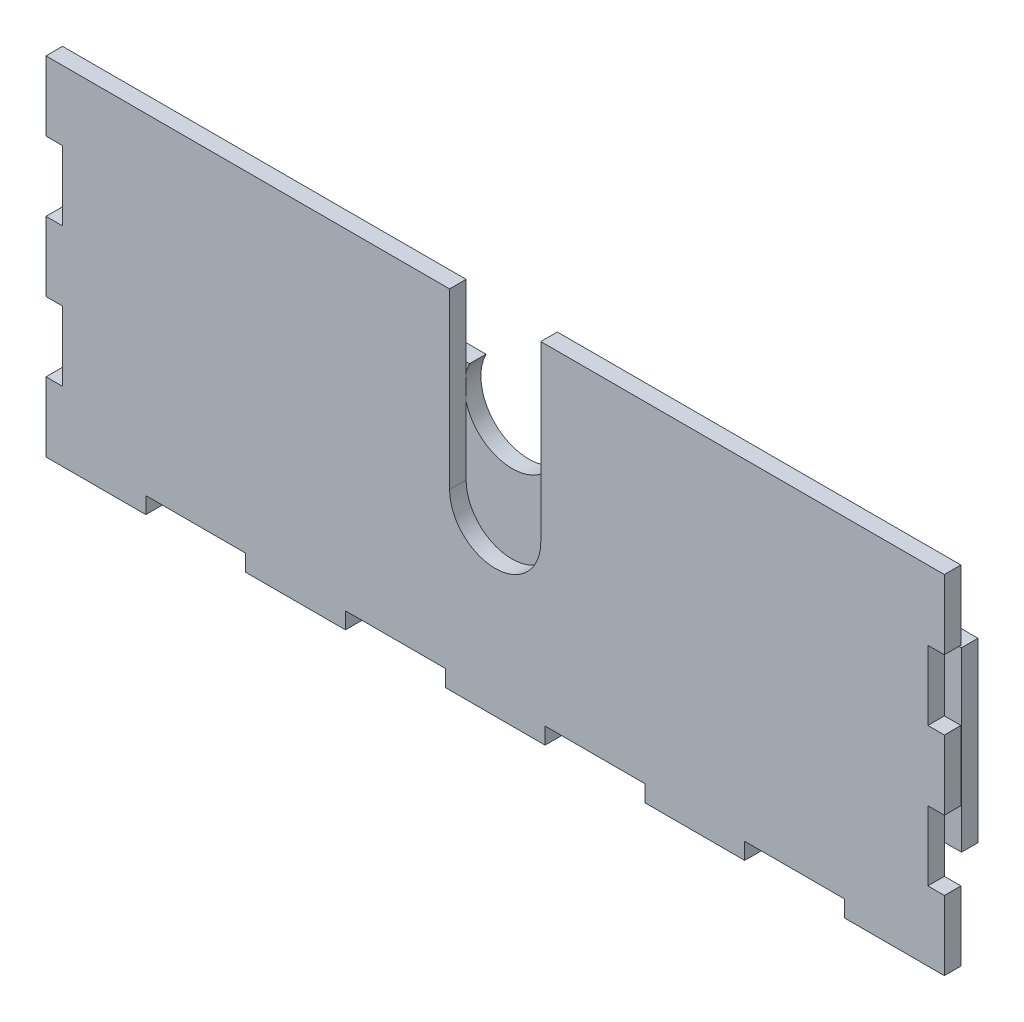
from build123d import *

# Parameters (mm, degrees)
BOSS_EXTRUDE1_DEPTH = 7.62
BOSS_EXTRUDE5_DEPTH = 7.62


with BuildPart() as part:
    # Sketch2 → Boss-Extrude1 (new body)
    with BuildSketch(Plane.XY):
        with BuildLine():
            Line((187.423058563, 0), (0, 0))
            Line((0, 0), (0, -81.548002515))
            Line((0, -81.548002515), (414.02, -81.548002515))
            Line((414.02, -81.548002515), (414.02, 0))
            Line((414.02, 0), (226.793058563, 0))
            ThreePointArc((226.793058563, 0), (207.108058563, -32.000114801), (187.423058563, 0))
        make_face()
    extrude(amount=BOSS_EXTRUDE1_DEPTH)


with BuildPart() as body_2:
    # Sketch5 → Boss-Extrude5 (new body)
    with BuildSketch(Plane.XY.offset(7.62)):
        with BuildLine():
            Line((185.883, 32.896397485), (185.883, -47.103602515))
            ThreePointArc((185.883, -47.103602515), (206.883, -68.103602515), (227.883, -47.103602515))
            Line((227.883, -47.103602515), (227.883, 32.896397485))
            Line((227.883, 32.896397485), (413.761309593, 32.896397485))
            Line((413.761309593, 32.896397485), (413.761309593, 0.896397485))
            Line((413.761309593, 0.896397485), (406.146, 0.896397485))
            Line((406.146, 0.896397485), (406.146, -31.103602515))
            Line((406.146, -31.103602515), (413.766, -31.103602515))
            Line((413.766, -31.103602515), (413.766, -63.103602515))
            Line((413.766, -63.103602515), (406.146, -63.103602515))
            Line((406.146, -63.103602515), (406.146, -95.103602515))
            Line((406.146, -95.103602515), (413.766, -95.103602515))
            Line((413.766, -95.103602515), (413.766, -127.103602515))
            Line((413.766, -127.103602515), (367.792, -127.103602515))
            Line((367.792, -127.103602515), (367.792, -119.483602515))
            Line((367.792, -119.483602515), (321.818, -119.483602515))
            Line((321.818, -119.483602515), (321.818, -127.103602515))
            Line((321.818, -127.103602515), (275.844, -127.103602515))
            Line((275.844, -127.103602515), (275.844, -119.483602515))
            Line((275.844, -119.483602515), (229.87, -119.483602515))
            Line((229.87, -119.483602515), (229.87, -127.103602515))
            Line((229.87, -127.103602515), (183.896, -127.103602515))
            Line((183.896, -127.103602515), (183.896, -119.483602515))
            Line((183.896, -119.483602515), (137.922, -119.483602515))
            Line((137.922, -119.483602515), (137.922, -127.103602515))
            Line((137.922, -127.103602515), (91.948, -127.103602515))
            Line((91.948, -127.103602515), (91.948, -119.483602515))
            Line((91.948, -119.483602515), (45.974, -119.483602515))
            Line((45.974, -119.483602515), (45.974, -127.103602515))
            Line((45.974, -127.103602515), (0, -127.103602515))
            Line((0, -127.103602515), (0, -95.103602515))
            Line((0, -95.103602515), (7.62, -95.103602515))
            Line((7.62, -95.103602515), (7.62, -63.103602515))
            Line((7.62, -63.103602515), (0, -63.103602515))
            Line((0, -63.103602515), (0, -31.103602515))
            Line((0, -31.103602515), (7.62, -31.103602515))
            Line((7.62, -31.103602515), (7.62, 0.896397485))
            Line((7.62, 0.896397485), (0, 0.896397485))
            Line((0, 0.896397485), (0, 32.896397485))
            Line((0, 32.896397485), (185.883, 32.896397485))
        make_face()
    extrude(amount=BOSS_EXTRUDE5_DEPTH)


solid = Compound([part.part, body_2.part])
